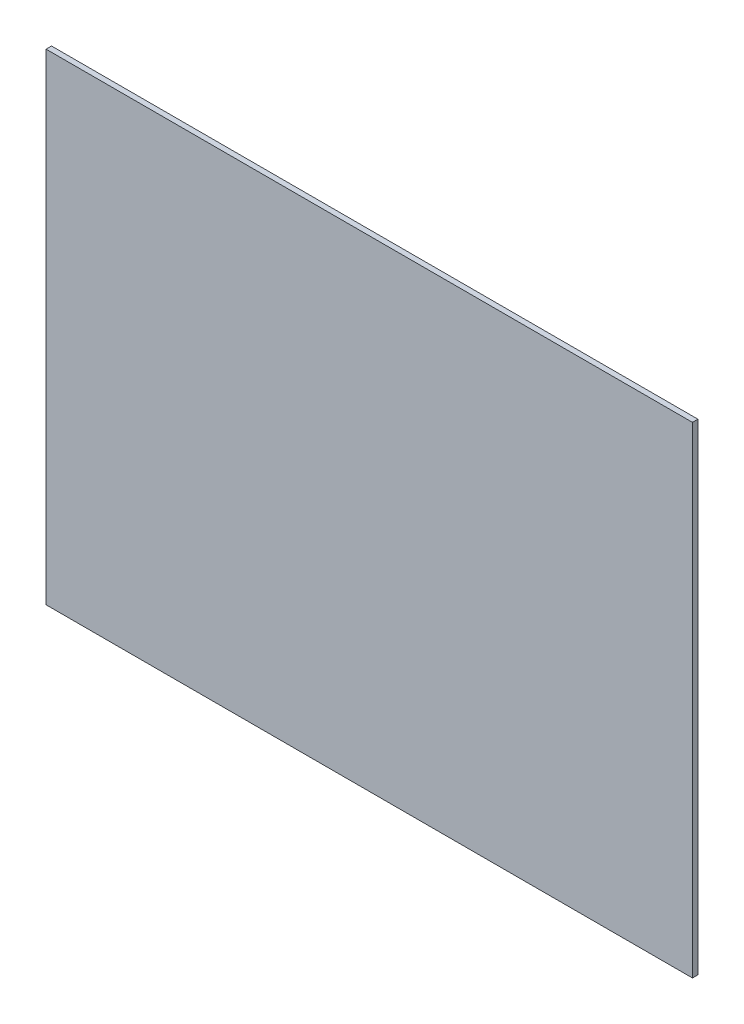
ISO-10303-21;
HEADER;
FILE_DESCRIPTION(('STEP AP214'),'2;1');
FILE_NAME('part.step','',(''),(''),'','','');
FILE_SCHEMA(('AUTOMOTIVE_DESIGN { 1 0 10303 214 1 1 1 1 }'));
ENDSEC;
DATA;
#1=APPLICATION_CONTEXT('core data for automotive mechanical design processes');
#2=APPLICATION_PROTOCOL_DEFINITION('international standard','automotive_design',2000,#1);
#3=PRODUCT_CONTEXT('',#1,'mechanical');
#4=PRODUCT('Part','Part','',(#3));
#5=PRODUCT_RELATED_PRODUCT_CATEGORY('part','',(#4));
#6=PRODUCT_DEFINITION_FORMATION('','',#4);
#7=PRODUCT_DEFINITION_CONTEXT('part definition',#1,'design');
#8=PRODUCT_DEFINITION('design','',#6,#7);
#9=PRODUCT_DEFINITION_SHAPE('','',#8);
#10=(LENGTH_UNIT() NAMED_UNIT(*) SI_UNIT(.MILLI.,.METRE.));
#11=(NAMED_UNIT(*) PLANE_ANGLE_UNIT() SI_UNIT($,.RADIAN.));
#12=(NAMED_UNIT(*) SI_UNIT($,.STERADIAN.) SOLID_ANGLE_UNIT());
#13=UNCERTAINTY_MEASURE_WITH_UNIT(LENGTH_MEASURE(1.E-05),#10,'distance_accuracy_value','');
#14=(GEOMETRIC_REPRESENTATION_CONTEXT(3) GLOBAL_UNCERTAINTY_ASSIGNED_CONTEXT((#13)) GLOBAL_UNIT_ASSIGNED_CONTEXT((#10,
#11,#12)) REPRESENTATION_CONTEXT('',''));
#15=CARTESIAN_POINT('',(0.,0.,0.));
#16=DIRECTION('',(0.,0.,1.));
#17=DIRECTION('',(1.,0.,0.));
#18=AXIS2_PLACEMENT_3D('',#15,#16,#17);
#19=CARTESIAN_POINT('',(18.8620495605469,23.84,-0.03048));
#20=DIRECTION('',(0.,-1.,0.));
#21=DIRECTION('',(0.,0.,-1.));
#22=AXIS2_PLACEMENT_3D('',#19,#20,#21);
#23=PLANE('',#22);
#24=DIRECTION('',(1.,0.,0.));
#25=VECTOR('',#24,1.);
#26=CARTESIAN_POINT('',(20.6620001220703,23.84,0.));
#27=LINE('',#26,#25);
#28=CARTESIAN_POINT('',(18.8620495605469,23.84,0.));
#29=VERTEX_POINT('',#28);
#30=CARTESIAN_POINT('',(22.4619506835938,23.84,0.));
#31=VERTEX_POINT('',#30);
#32=EDGE_CURVE('E172',#29,#31,#27,.T.);
#33=ORIENTED_EDGE('',*,*,#32,.T.);
#34=DIRECTION('',(0.,0.,-1.));
#35=VECTOR('',#34,1.);
#36=CARTESIAN_POINT('',(22.4619506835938,23.84,-0.01524));
#37=LINE('',#36,#35);
#38=CARTESIAN_POINT('',(22.4619506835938,23.84,-0.03048));
#39=VERTEX_POINT('',#38);
#40=EDGE_CURVE('E20',#31,#39,#37,.T.);
#41=ORIENTED_EDGE('',*,*,#40,.T.);
#42=DIRECTION('',(1.,0.,0.));
#43=VECTOR('',#42,1.);
#44=CARTESIAN_POINT('',(18.8620495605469,23.84,-0.03048));
#45=LINE('',#44,#43);
#46=CARTESIAN_POINT('',(18.8620495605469,23.84,-0.03048));
#47=VERTEX_POINT('',#46);
#48=EDGE_CURVE('E85',#47,#39,#45,.T.);
#49=ORIENTED_EDGE('',*,*,#48,.F.);
#50=DIRECTION('',(0.,0.,-1.));
#51=VECTOR('',#50,1.);
#52=CARTESIAN_POINT('',(18.8620495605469,23.84,-0.01524));
#53=LINE('',#52,#51);
#54=EDGE_CURVE('E11',#29,#47,#53,.T.);
#55=ORIENTED_EDGE('',*,*,#54,.F.);
#56=EDGE_LOOP('',(#33,#41,#49,#55));
#57=FACE_BOUND('',#56,.T.);
#58=ADVANCED_FACE('F17',(#57),#23,.F.);
#59=CARTESIAN_POINT('',(18.8620495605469,21.16,-0.03048));
#60=DIRECTION('',(1.,0.,0.));
#61=DIRECTION('',(0.,1.,0.));
#62=AXIS2_PLACEMENT_3D('',#59,#60,#61);
#63=PLANE('',#62);
#64=DIRECTION('',(0.,1.,0.));
#65=VECTOR('',#64,1.);
#66=CARTESIAN_POINT('',(18.8620495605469,22.5,0.));
#67=LINE('',#66,#65);
#68=CARTESIAN_POINT('',(18.8620495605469,21.16,0.));
#69=VERTEX_POINT('',#68);
#70=EDGE_CURVE('E76',#69,#29,#67,.T.);
#71=ORIENTED_EDGE('',*,*,#70,.T.);
#72=ORIENTED_EDGE('',*,*,#54,.T.);
#73=DIRECTION('',(0.,1.,0.));
#74=VECTOR('',#73,1.);
#75=CARTESIAN_POINT('',(18.8620495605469,21.16,-0.03048));
#76=LINE('',#75,#74);
#77=CARTESIAN_POINT('',(18.8620495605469,21.16,-0.03048));
#78=VERTEX_POINT('',#77);
#79=EDGE_CURVE('E73',#78,#47,#76,.T.);
#80=ORIENTED_EDGE('',*,*,#79,.F.);
#81=DIRECTION('',(0.,0.,-1.));
#82=VECTOR('',#81,1.);
#83=CARTESIAN_POINT('',(18.8620495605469,21.16,-0.01524));
#84=LINE('',#83,#82);
#85=EDGE_CURVE('E26',#69,#78,#84,.T.);
#86=ORIENTED_EDGE('',*,*,#85,.F.);
#87=EDGE_LOOP('',(#71,#72,#80,#86));
#88=FACE_BOUND('',#87,.T.);
#89=ADVANCED_FACE('F72',(#88),#63,.F.);
#90=CARTESIAN_POINT('',(22.4619506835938,21.16,-0.03048));
#91=DIRECTION('',(0.,1.,0.));
#92=DIRECTION('',(1.,0.,0.));
#93=AXIS2_PLACEMENT_3D('',#90,#91,#92);
#94=PLANE('',#93);
#95=DIRECTION('',(-1.,0.,0.));
#96=VECTOR('',#95,1.);
#97=CARTESIAN_POINT('',(20.6620001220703,21.16,0.));
#98=LINE('',#97,#96);
#99=CARTESIAN_POINT('',(22.4619506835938,21.16,0.));
#100=VERTEX_POINT('',#99);
#101=EDGE_CURVE('E97',#100,#69,#98,.T.);
#102=ORIENTED_EDGE('',*,*,#101,.T.);
#103=ORIENTED_EDGE('',*,*,#85,.T.);
#104=DIRECTION('',(-1.,0.,0.));
#105=VECTOR('',#104,1.);
#106=CARTESIAN_POINT('',(22.4619506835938,21.16,-0.03048));
#107=LINE('',#106,#105);
#108=CARTESIAN_POINT('',(22.4619506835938,21.16,-0.03048));
#109=VERTEX_POINT('',#108);
#110=EDGE_CURVE('E86',#109,#78,#107,.T.);
#111=ORIENTED_EDGE('',*,*,#110,.F.);
#112=DIRECTION('',(0.,0.,-1.));
#113=VECTOR('',#112,1.);
#114=CARTESIAN_POINT('',(22.4619506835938,21.16,-0.01524));
#115=LINE('',#114,#113);
#116=EDGE_CURVE('E51',#100,#109,#115,.T.);
#117=ORIENTED_EDGE('',*,*,#116,.F.);
#118=EDGE_LOOP('',(#102,#103,#111,#117));
#119=FACE_BOUND('',#118,.T.);
#120=ADVANCED_FACE('F130',(#119),#94,.F.);
#121=CARTESIAN_POINT('',(22.4619506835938,23.84,-0.03048));
#122=DIRECTION('',(-1.,0.,0.));
#123=DIRECTION('',(0.,0.,1.));
#124=AXIS2_PLACEMENT_3D('',#121,#122,#123);
#125=PLANE('',#124);
#126=DIRECTION('',(0.,-1.,0.));
#127=VECTOR('',#126,1.);
#128=CARTESIAN_POINT('',(22.4619506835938,22.5,0.));
#129=LINE('',#128,#127);
#130=EDGE_CURVE('E91',#31,#100,#129,.T.);
#131=ORIENTED_EDGE('',*,*,#130,.T.);
#132=ORIENTED_EDGE('',*,*,#116,.T.);
#133=DIRECTION('',(0.,-1.,0.));
#134=VECTOR('',#133,1.);
#135=CARTESIAN_POINT('',(22.4619506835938,23.84,-0.03048));
#136=LINE('',#135,#134);
#137=EDGE_CURVE('E90',#39,#109,#136,.T.);
#138=ORIENTED_EDGE('',*,*,#137,.F.);
#139=ORIENTED_EDGE('',*,*,#40,.F.);
#140=EDGE_LOOP('',(#131,#132,#138,#139));
#141=FACE_BOUND('',#140,.T.);
#142=ADVANCED_FACE('F116',(#141),#125,.F.);
#143=CARTESIAN_POINT('',(20.6620001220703,22.5,-0.03048));
#144=DIRECTION('',(0.,0.,1.));
#145=DIRECTION('',(1.,0.,0.));
#146=AXIS2_PLACEMENT_3D('',#143,#144,#145);
#147=PLANE('',#146);
#148=ORIENTED_EDGE('',*,*,#48,.T.);
#149=ORIENTED_EDGE('',*,*,#137,.T.);
#150=ORIENTED_EDGE('',*,*,#110,.T.);
#151=ORIENTED_EDGE('',*,*,#79,.T.);
#152=EDGE_LOOP('',(#148,#149,#150,#151));
#153=FACE_BOUND('',#152,.T.);
#154=ADVANCED_FACE('F83',(#153),#147,.F.);
#155=CARTESIAN_POINT('',(20.6620001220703,22.5,0.));
#156=DIRECTION('',(0.,0.,1.));
#157=DIRECTION('',(1.,0.,0.));
#158=AXIS2_PLACEMENT_3D('',#155,#156,#157);
#159=PLANE('',#158);
#160=ORIENTED_EDGE('',*,*,#32,.F.);
#161=ORIENTED_EDGE('',*,*,#70,.F.);
#162=ORIENTED_EDGE('',*,*,#101,.F.);
#163=ORIENTED_EDGE('',*,*,#130,.F.);
#164=EDGE_LOOP('',(#160,#161,#162,#163));
#165=FACE_BOUND('',#164,.T.);
#166=ADVANCED_FACE('F115',(#165),#159,.T.);
#167=CLOSED_SHELL('',(#58,#89,#120,#142,#154,#166));
#168=MANIFOLD_SOLID_BREP('B1',#167);
#169=ADVANCED_BREP_SHAPE_REPRESENTATION('',(#18,#168),#14);
#170=SHAPE_DEFINITION_REPRESENTATION(#9,#169);
ENDSEC;
END-ISO-10303-21;
